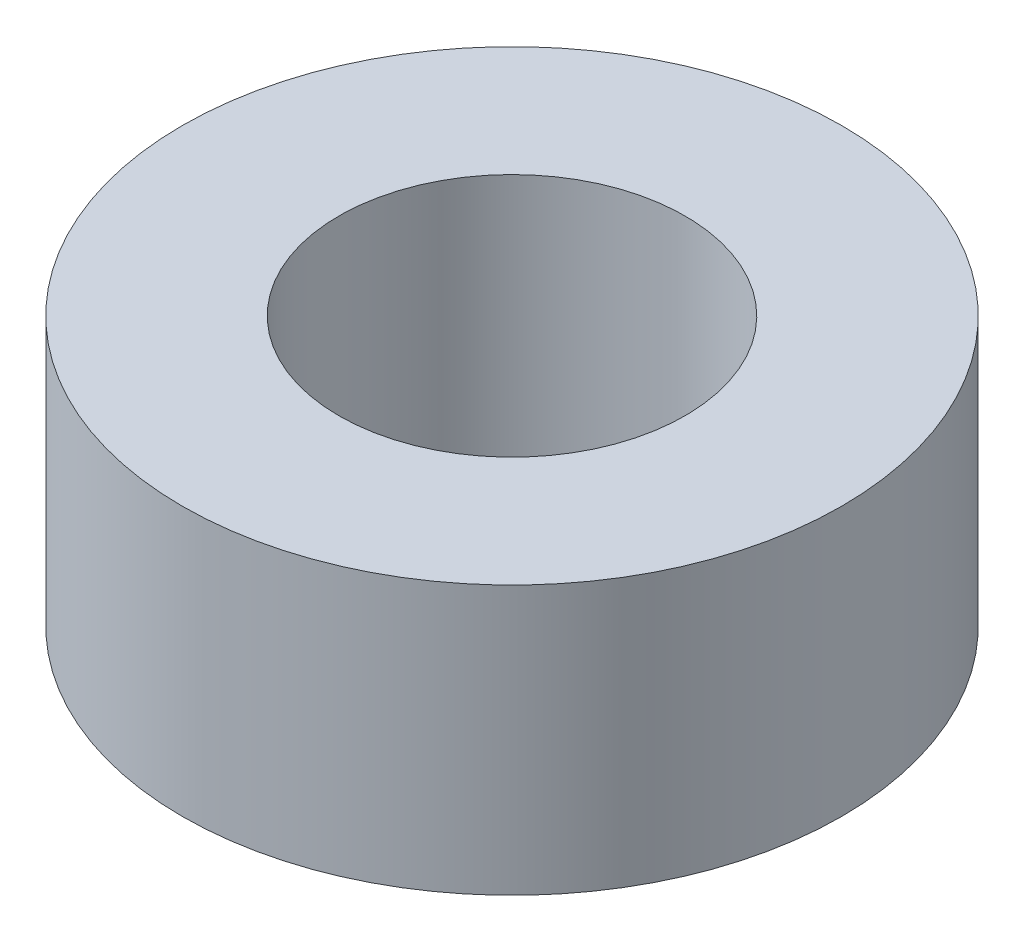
ISO-10303-21;
HEADER;
FILE_DESCRIPTION(('STEP AP214'),'2;1');
FILE_NAME('part.step','',(''),(''),'','','');
FILE_SCHEMA(('AUTOMOTIVE_DESIGN { 1 0 10303 214 1 1 1 1 }'));
ENDSEC;
DATA;
#1=APPLICATION_CONTEXT('core data for automotive mechanical design processes');
#2=APPLICATION_PROTOCOL_DEFINITION('international standard','automotive_design',2000,#1);
#3=PRODUCT_CONTEXT('',#1,'mechanical');
#4=PRODUCT('Part','Part','',(#3));
#5=PRODUCT_RELATED_PRODUCT_CATEGORY('part','',(#4));
#6=PRODUCT_DEFINITION_FORMATION('','',#4);
#7=PRODUCT_DEFINITION_CONTEXT('part definition',#1,'design');
#8=PRODUCT_DEFINITION('design','',#6,#7);
#9=PRODUCT_DEFINITION_SHAPE('','',#8);
#10=(LENGTH_UNIT() NAMED_UNIT(*) SI_UNIT(.MILLI.,.METRE.));
#11=(NAMED_UNIT(*) PLANE_ANGLE_UNIT() SI_UNIT($,.RADIAN.));
#12=(NAMED_UNIT(*) SI_UNIT($,.STERADIAN.) SOLID_ANGLE_UNIT());
#13=UNCERTAINTY_MEASURE_WITH_UNIT(LENGTH_MEASURE(1.E-05),#10,'distance_accuracy_value','');
#14=(GEOMETRIC_REPRESENTATION_CONTEXT(3) GLOBAL_UNCERTAINTY_ASSIGNED_CONTEXT((#13)) GLOBAL_UNIT_ASSIGNED_CONTEXT((#10,
#11,#12)) REPRESENTATION_CONTEXT('',''));
#15=CARTESIAN_POINT('',(0.,0.,0.));
#16=DIRECTION('',(0.,0.,1.));
#17=DIRECTION('',(1.,0.,0.));
#18=AXIS2_PLACEMENT_3D('',#15,#16,#17);
#19=CARTESIAN_POINT('',(0.,3.26,0.));
#20=DIRECTION('',(0.,1.,0.));
#21=DIRECTION('',(0.,0.,1.));
#22=AXIS2_PLACEMENT_3D('',#19,#20,#21);
#23=PLANE('',#22);
#24=CARTESIAN_POINT('',(0.,3.26,0.));
#25=DIRECTION('',(0.,1.,0.));
#26=DIRECTION('',(0.,0.,1.));
#27=AXIS2_PLACEMENT_3D('',#24,#25,#26);
#28=CIRCLE('',#27,4.);
#29=CARTESIAN_POINT('',(0.,3.26,4.));
#30=VERTEX_POINT('',#29);
#31=EDGE_CURVE('E10',#30,#30,#28,.T.);
#32=ORIENTED_EDGE('',*,*,#31,.T.);
#33=EDGE_LOOP('',(#32));
#34=FACE_BOUND('',#33,.T.);
#35=CARTESIAN_POINT('',(0.,3.26,0.));
#36=DIRECTION('',(0.,1.,0.));
#37=DIRECTION('',(0.,0.,1.));
#38=AXIS2_PLACEMENT_3D('',#35,#36,#37);
#39=CIRCLE('',#38,2.1);
#40=CARTESIAN_POINT('',(0.,3.26,2.1));
#41=VERTEX_POINT('',#40);
#42=EDGE_CURVE('E54',#41,#41,#39,.T.);
#43=ORIENTED_EDGE('',*,*,#42,.F.);
#44=EDGE_LOOP('',(#43));
#45=FACE_BOUND('',#44,.T.);
#46=ADVANCED_FACE('F41',(#34,#45),#23,.T.);
#47=CARTESIAN_POINT('',(0.,0.,0.));
#48=DIRECTION('',(0.,1.,0.));
#49=DIRECTION('',(0.,0.,1.));
#50=AXIS2_PLACEMENT_3D('',#47,#48,#49);
#51=PLANE('',#50);
#52=CARTESIAN_POINT('',(0.,0.,0.));
#53=DIRECTION('',(0.,1.,0.));
#54=DIRECTION('',(0.,0.,1.));
#55=AXIS2_PLACEMENT_3D('',#52,#53,#54);
#56=CIRCLE('',#55,4.);
#57=CARTESIAN_POINT('',(0.,0.,4.));
#58=VERTEX_POINT('',#57);
#59=EDGE_CURVE('E45',#58,#58,#56,.T.);
#60=ORIENTED_EDGE('',*,*,#59,.F.);
#61=EDGE_LOOP('',(#60));
#62=FACE_BOUND('',#61,.T.);
#63=CARTESIAN_POINT('',(0.,0.,0.));
#64=DIRECTION('',(0.,1.,0.));
#65=DIRECTION('',(0.,0.,1.));
#66=AXIS2_PLACEMENT_3D('',#63,#64,#65);
#67=CIRCLE('',#66,2.1);
#68=CARTESIAN_POINT('',(0.,0.,2.1));
#69=VERTEX_POINT('',#68);
#70=EDGE_CURVE('E56',#69,#69,#67,.T.);
#71=ORIENTED_EDGE('',*,*,#70,.T.);
#72=EDGE_LOOP('',(#71));
#73=FACE_BOUND('',#72,.T.);
#74=ADVANCED_FACE('F68',(#62,#73),#51,.F.);
#75=CARTESIAN_POINT('',(0.,3.26,0.));
#76=DIRECTION('',(0.,-1.,0.));
#77=DIRECTION('',(0.,0.,-1.));
#78=AXIS2_PLACEMENT_3D('',#75,#76,#77);
#79=CYLINDRICAL_SURFACE('',#78,4.);
#80=ORIENTED_EDGE('',*,*,#31,.F.);
#81=EDGE_LOOP('',(#80));
#82=FACE_BOUND('',#81,.T.);
#83=ORIENTED_EDGE('',*,*,#59,.T.);
#84=EDGE_LOOP('',(#83));
#85=FACE_BOUND('',#84,.T.);
#86=ADVANCED_FACE('F43',(#82,#85),#79,.T.);
#87=CARTESIAN_POINT('',(0.,3.26,0.));
#88=DIRECTION('',(0.,-1.,0.));
#89=DIRECTION('',(0.,0.,-1.));
#90=AXIS2_PLACEMENT_3D('',#87,#88,#89);
#91=CYLINDRICAL_SURFACE('',#90,2.1);
#92=ORIENTED_EDGE('',*,*,#42,.T.);
#93=EDGE_LOOP('',(#92));
#94=FACE_BOUND('',#93,.T.);
#95=ORIENTED_EDGE('',*,*,#70,.F.);
#96=EDGE_LOOP('',(#95));
#97=FACE_BOUND('',#96,.T.);
#98=ADVANCED_FACE('F64',(#94,#97),#91,.F.);
#99=CLOSED_SHELL('',(#46,#74,#86,#98));
#100=MANIFOLD_SOLID_BREP('B2',#99);
#101=ADVANCED_BREP_SHAPE_REPRESENTATION('',(#18,#100),#14);
#102=SHAPE_DEFINITION_REPRESENTATION(#9,#101);
ENDSEC;
END-ISO-10303-21;
